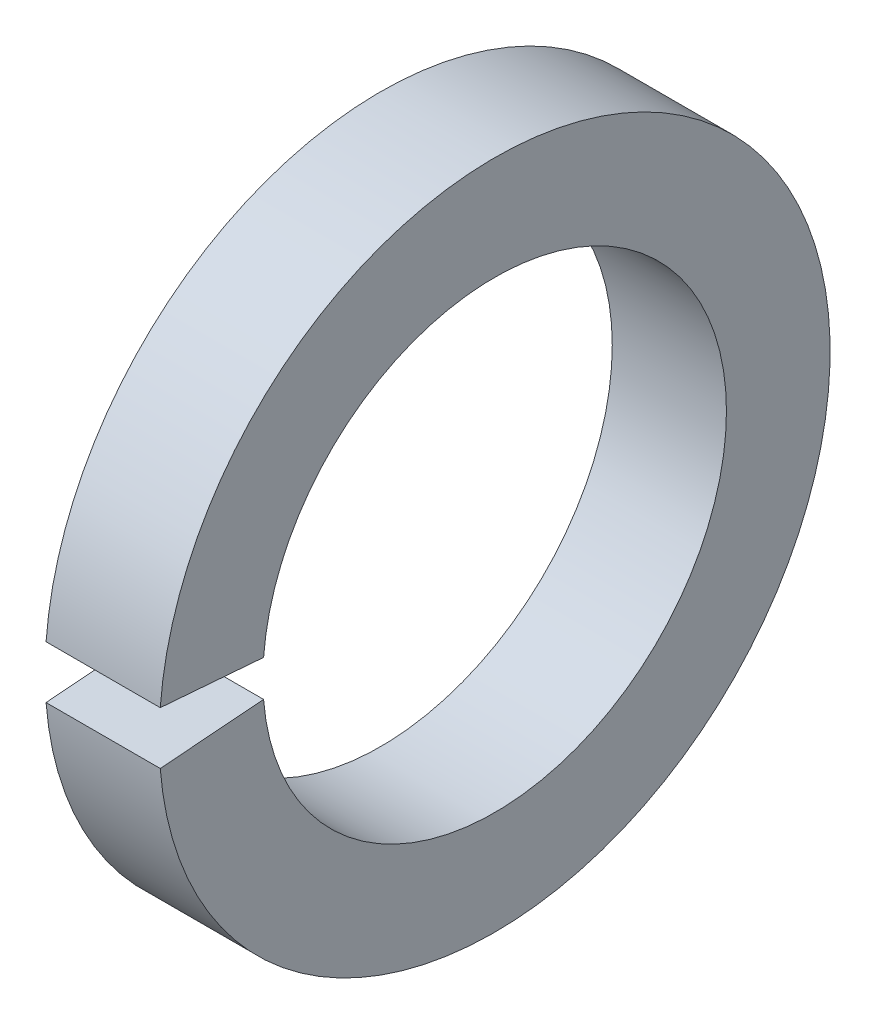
ISO-10303-21;
HEADER;
FILE_DESCRIPTION(('STEP AP214'),'2;1');
FILE_NAME('part.step','',(''),(''),'','','');
FILE_SCHEMA(('AUTOMOTIVE_DESIGN { 1 0 10303 214 1 1 1 1 }'));
ENDSEC;
DATA;
#1=APPLICATION_CONTEXT('core data for automotive mechanical design processes');
#2=APPLICATION_PROTOCOL_DEFINITION('international standard','automotive_design',2000,#1);
#3=PRODUCT_CONTEXT('',#1,'mechanical');
#4=PRODUCT('Part','Part','',(#3));
#5=PRODUCT_RELATED_PRODUCT_CATEGORY('part','',(#4));
#6=PRODUCT_DEFINITION_FORMATION('','',#4);
#7=PRODUCT_DEFINITION_CONTEXT('part definition',#1,'design');
#8=PRODUCT_DEFINITION('design','',#6,#7);
#9=PRODUCT_DEFINITION_SHAPE('','',#8);
#10=(LENGTH_UNIT() NAMED_UNIT(*) SI_UNIT(.MILLI.,.METRE.));
#11=(NAMED_UNIT(*) PLANE_ANGLE_UNIT() SI_UNIT($,.RADIAN.));
#12=(NAMED_UNIT(*) SI_UNIT($,.STERADIAN.) SOLID_ANGLE_UNIT());
#13=UNCERTAINTY_MEASURE_WITH_UNIT(LENGTH_MEASURE(1.E-05),#10,'distance_accuracy_value','');
#14=(GEOMETRIC_REPRESENTATION_CONTEXT(3) GLOBAL_UNCERTAINTY_ASSIGNED_CONTEXT((#13)) GLOBAL_UNIT_ASSIGNED_CONTEXT((#10,
#11,#12)) REPRESENTATION_CONTEXT('',''));
#15=CARTESIAN_POINT('',(0.,0.,0.));
#16=DIRECTION('',(0.,0.,1.));
#17=DIRECTION('',(1.,0.,0.));
#18=AXIS2_PLACEMENT_3D('',#15,#16,#17);
#19=CARTESIAN_POINT('',(-34.9249999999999,0.,0.));
#20=DIRECTION('',(-1.,0.,0.));
#21=DIRECTION('',(0.,0.,1.));
#22=AXIS2_PLACEMENT_3D('',#19,#20,#21);
#23=CYLINDRICAL_SURFACE('',#22,12.8905);
#24=CARTESIAN_POINT('',(0.,0.,0.));
#25=DIRECTION('',(-1.,0.,0.));
#26=DIRECTION('',(0.,0.,1.));
#27=AXIS2_PLACEMENT_3D('',#24,#25,#26);
#28=CIRCLE('',#27,12.8905);
#29=CARTESIAN_POINT('',(0.,1.01137697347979,12.8507628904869));
#30=VERTEX_POINT('',#29);
#31=CARTESIAN_POINT('',(0.,-1.01137697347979,12.8507628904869));
#32=VERTEX_POINT('',#31);
#33=EDGE_CURVE('E84',#30,#32,#28,.T.);
#34=ORIENTED_EDGE('',*,*,#33,.F.);
#35=DIRECTION('',(-1.,0.,0.));
#36=VECTOR('',#35,1.);
#37=CARTESIAN_POINT('',(-34.9249999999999,1.01137697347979,12.8507628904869));
#38=LINE('',#37,#36);
#39=CARTESIAN_POINT('',(-6.35,1.01137697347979,12.8507628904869));
#40=VERTEX_POINT('',#39);
#41=EDGE_CURVE('E98',#30,#40,#38,.T.);
#42=ORIENTED_EDGE('',*,*,#41,.T.);
#43=CARTESIAN_POINT('',(-6.35,0.,0.));
#44=DIRECTION('',(-1.,0.,0.));
#45=DIRECTION('',(0.,0.,1.));
#46=AXIS2_PLACEMENT_3D('',#43,#44,#45);
#47=CIRCLE('',#46,12.8905);
#48=CARTESIAN_POINT('',(-6.35,-1.01137697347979,12.8507628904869));
#49=VERTEX_POINT('',#48);
#50=EDGE_CURVE('E86',#40,#49,#47,.T.);
#51=ORIENTED_EDGE('',*,*,#50,.T.);
#52=DIRECTION('',(-1.,0.,0.));
#53=VECTOR('',#52,1.);
#54=CARTESIAN_POINT('',(-34.9249999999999,-1.01137697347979,12.8507628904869));
#55=LINE('',#54,#53);
#56=EDGE_CURVE('E54',#32,#49,#55,.T.);
#57=ORIENTED_EDGE('',*,*,#56,.F.);
#58=EDGE_LOOP('',(#34,#42,#51,#57));
#59=FACE_BOUND('',#58,.T.);
#60=ADVANCED_FACE('F33',(#59),#23,.F.);
#61=CARTESIAN_POINT('',(0.,12.8905,0.));
#62=DIRECTION('',(-1.,0.,0.));
#63=DIRECTION('',(0.,0.,1.));
#64=AXIS2_PLACEMENT_3D('',#61,#62,#63);
#65=PLANE('',#64);
#66=CARTESIAN_POINT('',(0.,0.,0.));
#67=DIRECTION('',(-1.,0.,0.));
#68=DIRECTION('',(0.,0.,1.));
#69=AXIS2_PLACEMENT_3D('',#66,#67,#68);
#70=CIRCLE('',#69,18.6563);
#71=CARTESIAN_POINT('',(0.,1.46375642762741,18.5987888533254));
#72=VERTEX_POINT('',#71);
#73=CARTESIAN_POINT('',(0.,-1.46375642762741,18.5987888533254));
#74=VERTEX_POINT('',#73);
#75=EDGE_CURVE('E90',#72,#74,#70,.T.);
#76=ORIENTED_EDGE('',*,*,#75,.F.);
#77=DIRECTION('',(0.,0.0784590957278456,0.996917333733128));
#78=VECTOR('',#77,1.);
#79=CARTESIAN_POINT('',(0.,0.,0.));
#80=LINE('',#79,#78);
#81=EDGE_CURVE('E78',#30,#72,#80,.T.);
#82=ORIENTED_EDGE('',*,*,#81,.F.);
#83=ORIENTED_EDGE('',*,*,#33,.T.);
#84=DIRECTION('',(0.,-0.0784590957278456,0.996917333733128));
#85=VECTOR('',#84,1.);
#86=CARTESIAN_POINT('',(0.,0.,0.));
#87=LINE('',#86,#85);
#88=EDGE_CURVE('E70',#32,#74,#87,.T.);
#89=ORIENTED_EDGE('',*,*,#88,.T.);
#90=EDGE_LOOP('',(#76,#82,#83,#89));
#91=FACE_BOUND('',#90,.T.);
#92=ADVANCED_FACE('F89',(#91),#65,.F.);
#93=CARTESIAN_POINT('',(-34.9249999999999,0.,0.));
#94=DIRECTION('',(-1.,0.,0.));
#95=DIRECTION('',(0.,0.,1.));
#96=AXIS2_PLACEMENT_3D('',#93,#94,#95);
#97=CYLINDRICAL_SURFACE('',#96,18.6563);
#98=CARTESIAN_POINT('',(-6.35,0.,0.));
#99=DIRECTION('',(-1.,0.,0.));
#100=DIRECTION('',(0.,0.,1.));
#101=AXIS2_PLACEMENT_3D('',#98,#99,#100);
#102=CIRCLE('',#101,18.6563);
#103=CARTESIAN_POINT('',(-6.35,1.46375642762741,18.5987888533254));
#104=VERTEX_POINT('',#103);
#105=CARTESIAN_POINT('',(-6.35,-1.46375642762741,18.5987888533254));
#106=VERTEX_POINT('',#105);
#107=EDGE_CURVE('E92',#104,#106,#102,.T.);
#108=ORIENTED_EDGE('',*,*,#107,.F.);
#109=DIRECTION('',(-1.,0.,0.));
#110=VECTOR('',#109,1.);
#111=CARTESIAN_POINT('',(-34.9249999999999,1.46375642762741,18.5987888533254));
#112=LINE('',#111,#110);
#113=EDGE_CURVE('E47',#104,#72,#112,.F.);
#114=ORIENTED_EDGE('',*,*,#113,.T.);
#115=ORIENTED_EDGE('',*,*,#75,.T.);
#116=DIRECTION('',(-1.,0.,0.));
#117=VECTOR('',#116,1.);
#118=CARTESIAN_POINT('',(-34.9249999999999,-1.46375642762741,18.5987888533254));
#119=LINE('',#118,#117);
#120=EDGE_CURVE('E73',#106,#74,#119,.F.);
#121=ORIENTED_EDGE('',*,*,#120,.F.);
#122=EDGE_LOOP('',(#108,#114,#115,#121));
#123=FACE_BOUND('',#122,.T.);
#124=ADVANCED_FACE('F105',(#123),#97,.T.);
#125=CARTESIAN_POINT('',(-6.35,18.6563,0.));
#126=DIRECTION('',(1.,0.,0.));
#127=DIRECTION('',(0.,0.,-1.));
#128=AXIS2_PLACEMENT_3D('',#125,#126,#127);
#129=PLANE('',#128);
#130=ORIENTED_EDGE('',*,*,#50,.F.);
#131=DIRECTION('',(0.,0.0784590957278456,0.996917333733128));
#132=VECTOR('',#131,1.);
#133=CARTESIAN_POINT('',(-6.35,0.114845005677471,1.45924415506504));
#134=LINE('',#133,#132);
#135=EDGE_CURVE('E11',#40,#104,#134,.T.);
#136=ORIENTED_EDGE('',*,*,#135,.T.);
#137=ORIENTED_EDGE('',*,*,#107,.T.);
#138=DIRECTION('',(0.,-0.0784590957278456,0.996917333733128));
#139=VECTOR('',#138,1.);
#140=CARTESIAN_POINT('',(-6.35,0.114845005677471,-1.45924415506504));
#141=LINE('',#140,#139);
#142=EDGE_CURVE('E40',#49,#106,#141,.T.);
#143=ORIENTED_EDGE('',*,*,#142,.F.);
#144=EDGE_LOOP('',(#130,#136,#137,#143));
#145=FACE_BOUND('',#144,.T.);
#146=ADVANCED_FACE('F107',(#145),#129,.F.);
#147=CARTESIAN_POINT('',(-6.35,0.,0.));
#148=DIRECTION('',(0.,0.996917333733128,0.0784590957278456));
#149=DIRECTION('',(0.,-0.0784590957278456,0.996917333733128));
#150=AXIS2_PLACEMENT_3D('',#147,#148,#149);
#151=PLANE('',#150);
#152=ORIENTED_EDGE('',*,*,#56,.T.);
#153=ORIENTED_EDGE('',*,*,#142,.T.);
#154=ORIENTED_EDGE('',*,*,#120,.T.);
#155=ORIENTED_EDGE('',*,*,#88,.F.);
#156=EDGE_LOOP('',(#152,#153,#154,#155));
#157=FACE_BOUND('',#156,.T.);
#158=ADVANCED_FACE('F71',(#157),#151,.T.);
#159=CARTESIAN_POINT('',(-6.35,0.,0.));
#160=DIRECTION('',(0.,0.996917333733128,-0.0784590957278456));
#161=DIRECTION('',(0.,0.0784590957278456,0.996917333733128));
#162=AXIS2_PLACEMENT_3D('',#159,#160,#161);
#163=PLANE('',#162);
#164=ORIENTED_EDGE('',*,*,#81,.T.);
#165=ORIENTED_EDGE('',*,*,#113,.F.);
#166=ORIENTED_EDGE('',*,*,#135,.F.);
#167=ORIENTED_EDGE('',*,*,#41,.F.);
#168=EDGE_LOOP('',(#164,#165,#166,#167));
#169=FACE_BOUND('',#168,.T.);
#170=ADVANCED_FACE('F102',(#169),#163,.F.);
#171=CLOSED_SHELL('',(#60,#92,#124,#146,#158,#170));
#172=MANIFOLD_SOLID_BREP('B2',#171);
#173=ADVANCED_BREP_SHAPE_REPRESENTATION('',(#18,#172),#14);
#174=SHAPE_DEFINITION_REPRESENTATION(#9,#173);
ENDSEC;
END-ISO-10303-21;
